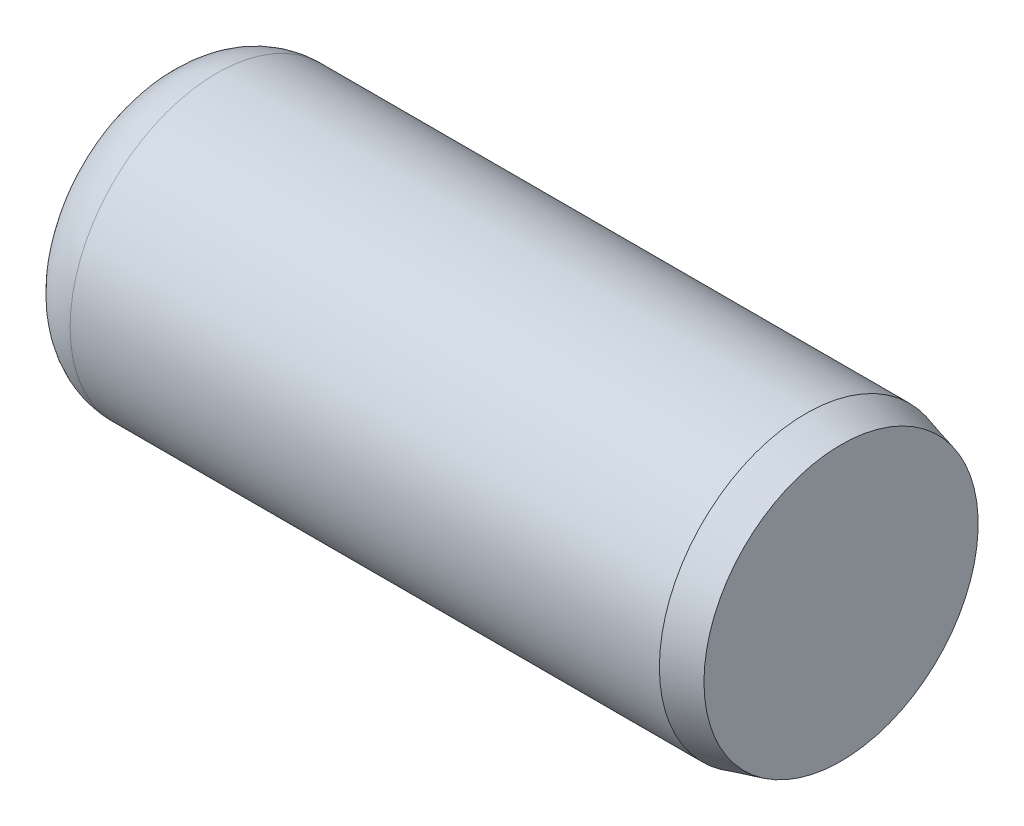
ISO-10303-21;
HEADER;
FILE_DESCRIPTION(('STEP AP214'),'2;1');
FILE_NAME('part.step','',(''),(''),'','','');
FILE_SCHEMA(('AUTOMOTIVE_DESIGN { 1 0 10303 214 1 1 1 1 }'));
ENDSEC;
DATA;
#1=APPLICATION_CONTEXT('core data for automotive mechanical design processes');
#2=APPLICATION_PROTOCOL_DEFINITION('international standard','automotive_design',2000,#1);
#3=PRODUCT_CONTEXT('',#1,'mechanical');
#4=PRODUCT('Part','Part','',(#3));
#5=PRODUCT_RELATED_PRODUCT_CATEGORY('part','',(#4));
#6=PRODUCT_DEFINITION_FORMATION('','',#4);
#7=PRODUCT_DEFINITION_CONTEXT('part definition',#1,'design');
#8=PRODUCT_DEFINITION('design','',#6,#7);
#9=PRODUCT_DEFINITION_SHAPE('','',#8);
#10=(LENGTH_UNIT() NAMED_UNIT(*) SI_UNIT(.MILLI.,.METRE.));
#11=(NAMED_UNIT(*) PLANE_ANGLE_UNIT() SI_UNIT($,.RADIAN.));
#12=(NAMED_UNIT(*) SI_UNIT($,.STERADIAN.) SOLID_ANGLE_UNIT());
#13=UNCERTAINTY_MEASURE_WITH_UNIT(LENGTH_MEASURE(1.E-05),#10,'distance_accuracy_value','');
#14=(GEOMETRIC_REPRESENTATION_CONTEXT(3) GLOBAL_UNCERTAINTY_ASSIGNED_CONTEXT((#13)) GLOBAL_UNIT_ASSIGNED_CONTEXT((#10,
#11,#12)) REPRESENTATION_CONTEXT('',''));
#15=CARTESIAN_POINT('',(0.,0.,0.));
#16=DIRECTION('',(0.,0.,1.));
#17=DIRECTION('',(1.,0.,0.));
#18=AXIS2_PLACEMENT_3D('',#15,#16,#17);
#19=CARTESIAN_POINT('',(11.1125,0.,0.));
#20=DIRECTION('',(-1.,0.,0.));
#21=DIRECTION('',(0.,0.,1.));
#22=AXIS2_PLACEMENT_3D('',#19,#20,#21);
#23=PLANE('',#22);
#24=CARTESIAN_POINT('',(11.1125000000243,0.,0.));
#25=DIRECTION('',(-1.,0.,0.));
#26=DIRECTION('',(0.,0.,1.));
#27=AXIS2_PLACEMENT_3D('',#24,#25,#26);
#28=CIRCLE('',#27,2.23049369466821);
#29=CARTESIAN_POINT('',(11.1125000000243,0.,2.23049369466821));
#30=VERTEX_POINT('',#29);
#31=EDGE_CURVE('E41',#30,#30,#28,.T.);
#32=ORIENTED_EDGE('',*,*,#31,.F.);
#33=EDGE_LOOP('',(#32));
#34=FACE_BOUND('',#33,.T.);
#35=ADVANCED_FACE('F16',(#34),#23,.F.);
#36=CARTESIAN_POINT('',(0.,1.43027399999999,0.));
#37=DIRECTION('',(1.,0.,0.));
#38=DIRECTION('',(0.,0.,-1.));
#39=AXIS2_PLACEMENT_3D('',#36,#37,#38);
#40=PLANE('',#39);
#41=CARTESIAN_POINT('',(0.,0.,0.));
#42=DIRECTION('',(1.,0.,0.));
#43=DIRECTION('',(0.,0.,1.));
#44=AXIS2_PLACEMENT_3D('',#41,#42,#43);
#45=CIRCLE('',#44,1.43027399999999);
#46=CARTESIAN_POINT('',(0.,0.,1.43027399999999));
#47=VERTEX_POINT('',#46);
#48=CARTESIAN_POINT('',(0.,0.,-1.43027399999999));
#49=VERTEX_POINT('',#48);
#50=EDGE_CURVE('E33',#47,#49,#45,.T.);
#51=ORIENTED_EDGE('',*,*,#50,.F.);
#52=CARTESIAN_POINT('',(0.,0.,0.));
#53=DIRECTION('',(1.,0.,0.));
#54=DIRECTION('',(0.,0.,-1.));
#55=AXIS2_PLACEMENT_3D('',#52,#53,#54);
#56=CIRCLE('',#55,1.43027399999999);
#57=EDGE_CURVE('E39',#49,#47,#56,.T.);
#58=ORIENTED_EDGE('',*,*,#57,.F.);
#59=EDGE_LOOP('',(#51,#58));
#60=FACE_BOUND('',#59,.T.);
#61=ADVANCED_FACE('F44',(#60),#40,.F.);
#62=CARTESIAN_POINT('',(10.5403903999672,0.,0.));
#63=DIRECTION('',(-1.,0.,0.));
#64=DIRECTION('',(0.,0.,1.));
#65=AXIS2_PLACEMENT_3D('',#62,#63,#64);
#66=CONICAL_SURFACE('',#65,2.38379000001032,0.261799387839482);
#67=CARTESIAN_POINT('',(10.5403904,0.,0.));
#68=DIRECTION('',(-1.,0.,0.));
#69=DIRECTION('',(0.,0.,1.));
#70=AXIS2_PLACEMENT_3D('',#67,#68,#69);
#71=CIRCLE('',#70,2.38378999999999);
#72=CARTESIAN_POINT('',(10.5403904,0.,2.38378999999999));
#73=VERTEX_POINT('',#72);
#74=EDGE_CURVE('E26',#73,#73,#71,.T.);
#75=ORIENTED_EDGE('',*,*,#74,.F.);
#76=EDGE_LOOP('',(#75));
#77=FACE_BOUND('',#76,.T.);
#78=ORIENTED_EDGE('',*,*,#31,.T.);
#79=EDGE_LOOP('',(#78));
#80=FACE_BOUND('',#79,.T.);
#81=ADVANCED_FACE('F60',(#77,#80),#66,.T.);
#82=CARTESIAN_POINT('',(0.953516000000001,0.,0.));
#83=DIRECTION('',(-1.,0.,0.));
#84=DIRECTION('',(0.,0.,1.));
#85=AXIS2_PLACEMENT_3D('',#82,#83,#84);
#86=TOROIDAL_SURFACE('',#85,1.43027399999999,0.953516);
#87=ORIENTED_EDGE('',*,*,#50,.T.);
#88=ORIENTED_EDGE('',*,*,#57,.T.);
#89=EDGE_LOOP('',(#87,#88));
#90=FACE_BOUND('',#89,.T.);
#91=CARTESIAN_POINT('',(0.953516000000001,0.,0.));
#92=DIRECTION('',(-1.,0.,0.));
#93=DIRECTION('',(0.,0.,1.));
#94=AXIS2_PLACEMENT_3D('',#91,#92,#93);
#95=CIRCLE('',#94,2.38378999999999);
#96=CARTESIAN_POINT('',(0.953516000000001,0.,2.38378999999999));
#97=VERTEX_POINT('',#96);
#98=EDGE_CURVE('E11',#97,#97,#95,.F.);
#99=ORIENTED_EDGE('',*,*,#98,.F.);
#100=EDGE_LOOP('',(#99));
#101=FACE_BOUND('',#100,.T.);
#102=ADVANCED_FACE('F37',(#90,#101),#86,.T.);
#103=CARTESIAN_POINT('',(-6.35,0.,0.));
#104=DIRECTION('',(-1.,0.,0.));
#105=DIRECTION('',(0.,0.,1.));
#106=AXIS2_PLACEMENT_3D('',#103,#104,#105);
#107=CYLINDRICAL_SURFACE('',#106,2.38378999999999);
#108=ORIENTED_EDGE('',*,*,#98,.T.);
#109=EDGE_LOOP('',(#108));
#110=FACE_BOUND('',#109,.T.);
#111=ORIENTED_EDGE('',*,*,#74,.T.);
#112=EDGE_LOOP('',(#111));
#113=FACE_BOUND('',#112,.T.);
#114=ADVANCED_FACE('F68',(#110,#113),#107,.T.);
#115=CLOSED_SHELL('',(#35,#61,#81,#102,#114));
#116=MANIFOLD_SOLID_BREP('B1',#115);
#117=ADVANCED_BREP_SHAPE_REPRESENTATION('',(#18,#116),#14);
#118=SHAPE_DEFINITION_REPRESENTATION(#9,#117);
ENDSEC;
END-ISO-10303-21;
